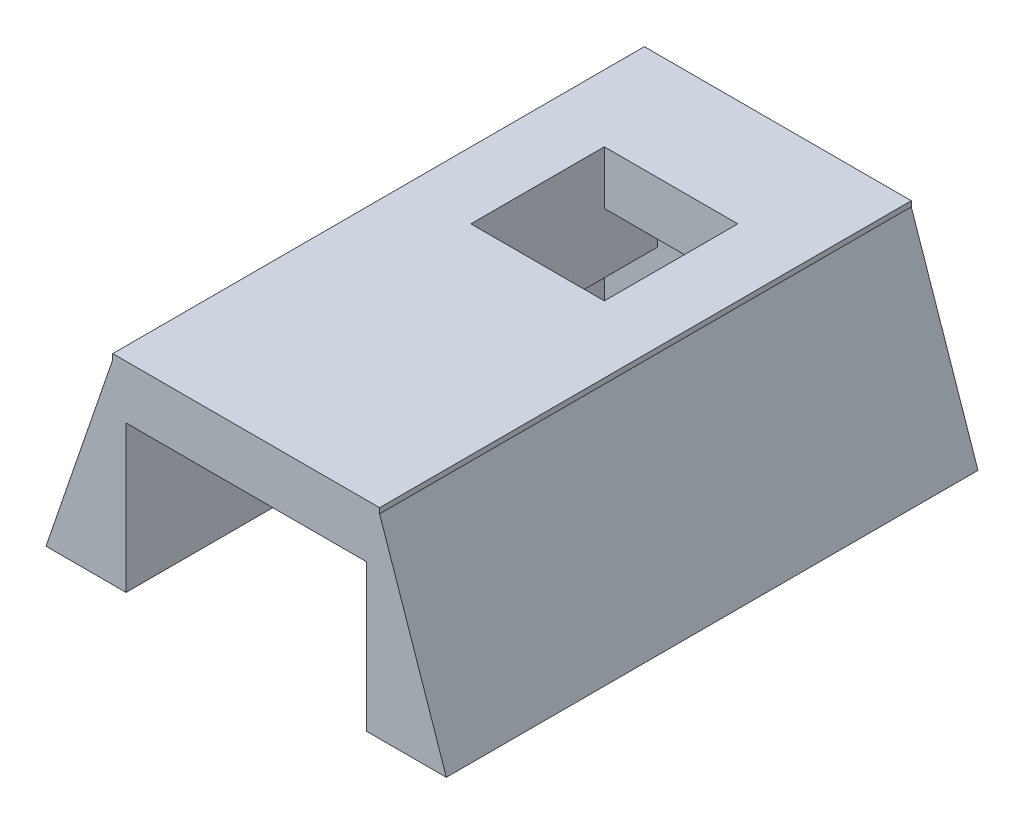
ISO-10303-21;
HEADER;
FILE_DESCRIPTION(('STEP AP214'),'2;1');
FILE_NAME('part.step','',(''),(''),'','','');
FILE_SCHEMA(('AUTOMOTIVE_DESIGN { 1 0 10303 214 1 1 1 1 }'));
ENDSEC;
DATA;
#1=APPLICATION_CONTEXT('core data for automotive mechanical design processes');
#2=APPLICATION_PROTOCOL_DEFINITION('international standard','automotive_design',2000,#1);
#3=PRODUCT_CONTEXT('',#1,'mechanical');
#4=PRODUCT('Part','Part','',(#3));
#5=PRODUCT_RELATED_PRODUCT_CATEGORY('part','',(#4));
#6=PRODUCT_DEFINITION_FORMATION('','',#4);
#7=PRODUCT_DEFINITION_CONTEXT('part definition',#1,'design');
#8=PRODUCT_DEFINITION('design','',#6,#7);
#9=PRODUCT_DEFINITION_SHAPE('','',#8);
#10=(LENGTH_UNIT() NAMED_UNIT(*) SI_UNIT(.MILLI.,.METRE.));
#11=(NAMED_UNIT(*) PLANE_ANGLE_UNIT() SI_UNIT($,.RADIAN.));
#12=(NAMED_UNIT(*) SI_UNIT($,.STERADIAN.) SOLID_ANGLE_UNIT());
#13=UNCERTAINTY_MEASURE_WITH_UNIT(LENGTH_MEASURE(1.E-05),#10,'distance_accuracy_value','');
#14=(GEOMETRIC_REPRESENTATION_CONTEXT(3) GLOBAL_UNCERTAINTY_ASSIGNED_CONTEXT((#13)) GLOBAL_UNIT_ASSIGNED_CONTEXT((#10,
#11,#12)) REPRESENTATION_CONTEXT('',''));
#15=CARTESIAN_POINT('',(0.,0.,0.));
#16=DIRECTION('',(0.,0.,1.));
#17=DIRECTION('',(1.,0.,0.));
#18=AXIS2_PLACEMENT_3D('',#15,#16,#17);
#19=CARTESIAN_POINT('',(0.,5.5,0.));
#20=DIRECTION('',(0.,-1.,0.));
#21=DIRECTION('',(1.,0.,0.));
#22=AXIS2_PLACEMENT_3D('',#19,#20,#21);
#23=PLANE('',#22);
#24=DIRECTION('',(1.,0.,0.));
#25=VECTOR('',#24,1.);
#26=CARTESIAN_POINT('',(0.,5.5,4.));
#27=LINE('',#26,#25);
#28=CARTESIAN_POINT('',(-2.5,5.5,4.));
#29=VERTEX_POINT('',#28);
#30=CARTESIAN_POINT('',(2.5,5.5,4.));
#31=VERTEX_POINT('',#30);
#32=EDGE_CURVE('E11',#29,#31,#27,.T.);
#33=ORIENTED_EDGE('',*,*,#32,.F.);
#34=DIRECTION('',(0.,0.,1.));
#35=VECTOR('',#34,1.);
#36=CARTESIAN_POINT('',(-2.5,5.5,11.));
#37=LINE('',#36,#35);
#38=CARTESIAN_POINT('',(-2.5,5.5,2.));
#39=VERTEX_POINT('',#38);
#40=EDGE_CURVE('E238',#39,#29,#37,.T.);
#41=ORIENTED_EDGE('',*,*,#40,.F.);
#42=DIRECTION('',(-1.,0.,0.));
#43=VECTOR('',#42,1.);
#44=CARTESIAN_POINT('',(0.,5.5,2.));
#45=LINE('',#44,#43);
#46=CARTESIAN_POINT('',(2.5,5.5,2.));
#47=VERTEX_POINT('',#46);
#48=EDGE_CURVE('E203',#47,#39,#45,.T.);
#49=ORIENTED_EDGE('',*,*,#48,.F.);
#50=DIRECTION('',(0.,0.,-1.));
#51=VECTOR('',#50,1.);
#52=CARTESIAN_POINT('',(2.5,5.5,11.));
#53=LINE('',#52,#51);
#54=EDGE_CURVE('E234',#31,#47,#53,.T.);
#55=ORIENTED_EDGE('',*,*,#54,.F.);
#56=EDGE_LOOP('',(#33,#41,#49,#55));
#57=FACE_BOUND('',#56,.T.);
#58=ADVANCED_FACE('F34',(#57),#23,.T.);
#59=CARTESIAN_POINT('',(-4.5,5.5,11.));
#60=DIRECTION('',(1.,0.,0.));
#61=DIRECTION('',(0.,0.,-1.));
#62=AXIS2_PLACEMENT_3D('',#59,#60,#61);
#63=PLANE('',#62);
#64=DIRECTION('',(0.,0.,1.));
#65=VECTOR('',#64,1.);
#66=CARTESIAN_POINT('',(-4.5,0.,11.));
#67=LINE('',#66,#65);
#68=CARTESIAN_POINT('',(-4.5,0.,2.));
#69=VERTEX_POINT('',#68);
#70=CARTESIAN_POINT('',(-4.5,0.,19.92051609));
#71=VERTEX_POINT('',#70);
#72=EDGE_CURVE('E230',#69,#71,#67,.T.);
#73=ORIENTED_EDGE('',*,*,#72,.F.);
#74=DIRECTION('',(0.,1.,0.));
#75=VECTOR('',#74,1.);
#76=CARTESIAN_POINT('',(-4.5,5.5,2.));
#77=LINE('',#76,#75);
#78=CARTESIAN_POINT('',(-4.5,3.25,2.));
#79=VERTEX_POINT('',#78);
#80=EDGE_CURVE('E212',#69,#79,#77,.T.);
#81=ORIENTED_EDGE('',*,*,#80,.T.);
#82=DIRECTION('',(0.,0.,-1.));
#83=VECTOR('',#82,1.);
#84=CARTESIAN_POINT('',(-4.5,3.25,19.92051609));
#85=LINE('',#84,#83);
#86=CARTESIAN_POINT('',(-4.5,3.25,11.));
#87=VERTEX_POINT('',#86);
#88=EDGE_CURVE('E215',#87,#79,#85,.T.);
#89=ORIENTED_EDGE('',*,*,#88,.F.);
#90=DIRECTION('',(0.,-1.,0.));
#91=VECTOR('',#90,1.);
#92=CARTESIAN_POINT('',(-4.5,5.5,11.));
#93=LINE('',#92,#91);
#94=CARTESIAN_POINT('',(-4.5,5.5,11.));
#95=VERTEX_POINT('',#94);
#96=EDGE_CURVE('E261',#95,#87,#93,.T.);
#97=ORIENTED_EDGE('',*,*,#96,.F.);
#98=DIRECTION('',(0.,0.,1.));
#99=VECTOR('',#98,1.);
#100=CARTESIAN_POINT('',(-4.5,5.5,11.));
#101=LINE('',#100,#99);
#102=CARTESIAN_POINT('',(-4.5,5.5,19.92051609));
#103=VERTEX_POINT('',#102);
#104=EDGE_CURVE('E243',#95,#103,#101,.T.);
#105=ORIENTED_EDGE('',*,*,#104,.T.);
#106=DIRECTION('',(0.,-1.,0.));
#107=VECTOR('',#106,1.);
#108=CARTESIAN_POINT('',(-4.5,5.5,19.92051609));
#109=LINE('',#108,#107);
#110=EDGE_CURVE('E258',#103,#71,#109,.T.);
#111=ORIENTED_EDGE('',*,*,#110,.T.);
#112=EDGE_LOOP('',(#73,#81,#89,#97,#105,#111));
#113=FACE_BOUND('',#112,.T.);
#114=ADVANCED_FACE('F329',(#113),#63,.T.);
#115=CARTESIAN_POINT('',(4.5,5.5,11.));
#116=DIRECTION('',(-1.,0.,0.));
#117=DIRECTION('',(0.,0.,1.));
#118=AXIS2_PLACEMENT_3D('',#115,#116,#117);
#119=PLANE('',#118);
#120=DIRECTION('',(0.,0.,-1.));
#121=VECTOR('',#120,1.);
#122=CARTESIAN_POINT('',(4.5,3.25,19.92051609));
#123=LINE('',#122,#121);
#124=CARTESIAN_POINT('',(4.5,3.25,11.));
#125=VERTEX_POINT('',#124);
#126=CARTESIAN_POINT('',(4.5,3.25,2.));
#127=VERTEX_POINT('',#126);
#128=EDGE_CURVE('E216',#125,#127,#123,.T.);
#129=ORIENTED_EDGE('',*,*,#128,.T.);
#130=DIRECTION('',(0.,-1.,0.));
#131=VECTOR('',#130,1.);
#132=CARTESIAN_POINT('',(4.5,5.5,2.));
#133=LINE('',#132,#131);
#134=CARTESIAN_POINT('',(4.5,0.,2.));
#135=VERTEX_POINT('',#134);
#136=EDGE_CURVE('E208',#127,#135,#133,.T.);
#137=ORIENTED_EDGE('',*,*,#136,.T.);
#138=DIRECTION('',(0.,0.,-1.));
#139=VECTOR('',#138,1.);
#140=CARTESIAN_POINT('',(4.5,0.,11.));
#141=LINE('',#140,#139);
#142=CARTESIAN_POINT('',(4.5,0.,19.92051609));
#143=VERTEX_POINT('',#142);
#144=EDGE_CURVE('E235',#143,#135,#141,.T.);
#145=ORIENTED_EDGE('',*,*,#144,.F.);
#146=DIRECTION('',(0.,-1.,0.));
#147=VECTOR('',#146,1.);
#148=CARTESIAN_POINT('',(4.5,5.5,19.92051609));
#149=LINE('',#148,#147);
#150=CARTESIAN_POINT('',(4.5,5.5,19.92051609));
#151=VERTEX_POINT('',#150);
#152=EDGE_CURVE('E256',#151,#143,#149,.T.);
#153=ORIENTED_EDGE('',*,*,#152,.F.);
#154=DIRECTION('',(0.,0.,-1.));
#155=VECTOR('',#154,1.);
#156=CARTESIAN_POINT('',(4.5,5.5,11.));
#157=LINE('',#156,#155);
#158=CARTESIAN_POINT('',(4.5,5.5,11.));
#159=VERTEX_POINT('',#158);
#160=EDGE_CURVE('E248',#151,#159,#157,.T.);
#161=ORIENTED_EDGE('',*,*,#160,.T.);
#162=DIRECTION('',(0.,-1.,0.));
#163=VECTOR('',#162,1.);
#164=CARTESIAN_POINT('',(4.5,5.5,11.));
#165=LINE('',#164,#163);
#166=EDGE_CURVE('E250',#159,#125,#165,.T.);
#167=ORIENTED_EDGE('',*,*,#166,.T.);
#168=EDGE_LOOP('',(#129,#137,#145,#153,#161,#167));
#169=FACE_BOUND('',#168,.T.);
#170=ADVANCED_FACE('F352',(#169),#119,.T.);
#171=CARTESIAN_POINT('',(4.5,3.25,19.92051609));
#172=DIRECTION('',(0.,1.,0.));
#173=DIRECTION('',(0.,0.,1.));
#174=AXIS2_PLACEMENT_3D('',#171,#172,#173);
#175=PLANE('',#174);
#176=DIRECTION('',(-1.,0.,0.));
#177=VECTOR('',#176,1.);
#178=CARTESIAN_POINT('',(-6.,3.25,2.));
#179=LINE('',#178,#177);
#180=CARTESIAN_POINT('',(-2.5,3.25,2.));
#181=VERTEX_POINT('',#180);
#182=EDGE_CURVE('E205',#181,#79,#179,.T.);
#183=ORIENTED_EDGE('',*,*,#182,.F.);
#184=DIRECTION('',(0.,0.,1.));
#185=VECTOR('',#184,1.);
#186=CARTESIAN_POINT('',(-2.5,3.25,11.));
#187=LINE('',#186,#185);
#188=CARTESIAN_POINT('',(-2.5,3.25,11.));
#189=VERTEX_POINT('',#188);
#190=EDGE_CURVE('E224',#181,#189,#187,.T.);
#191=ORIENTED_EDGE('',*,*,#190,.T.);
#192=DIRECTION('',(-1.,0.,0.));
#193=VECTOR('',#192,1.);
#194=CARTESIAN_POINT('',(-2.5,3.25,11.));
#195=LINE('',#194,#193);
#196=EDGE_CURVE('E219',#189,#87,#195,.T.);
#197=ORIENTED_EDGE('',*,*,#196,.T.);
#198=ORIENTED_EDGE('',*,*,#88,.T.);
#199=EDGE_LOOP('',(#183,#191,#197,#198));
#200=FACE_BOUND('',#199,.T.);
#201=ADVANCED_FACE('F333',(#200),#175,.F.);
#202=DIRECTION('',(-1.,0.,0.));
#203=VECTOR('',#202,1.);
#204=CARTESIAN_POINT('',(4.5,3.25,2.));
#205=LINE('',#204,#203);
#206=CARTESIAN_POINT('',(2.5,3.25,2.));
#207=VERTEX_POINT('',#206);
#208=EDGE_CURVE('E314',#127,#207,#205,.T.);
#209=ORIENTED_EDGE('',*,*,#208,.F.);
#210=ORIENTED_EDGE('',*,*,#128,.F.);
#211=DIRECTION('',(-1.,0.,0.));
#212=VECTOR('',#211,1.);
#213=CARTESIAN_POINT('',(2.5,3.25,11.));
#214=LINE('',#213,#212);
#215=CARTESIAN_POINT('',(2.5,3.25,11.));
#216=VERTEX_POINT('',#215);
#217=EDGE_CURVE('E228',#125,#216,#214,.T.);
#218=ORIENTED_EDGE('',*,*,#217,.T.);
#219=DIRECTION('',(0.,0.,-1.));
#220=VECTOR('',#219,1.);
#221=CARTESIAN_POINT('',(2.5,3.25,11.));
#222=LINE('',#221,#220);
#223=EDGE_CURVE('E226',#216,#207,#222,.T.);
#224=ORIENTED_EDGE('',*,*,#223,.T.);
#225=EDGE_LOOP('',(#209,#210,#218,#224));
#226=FACE_BOUND('',#225,.T.);
#227=ADVANCED_FACE('F349',(#226),#175,.F.);
#228=CARTESIAN_POINT('',(-7.5,0.,19.92051609));
#229=DIRECTION('',(0.,1.,0.));
#230=DIRECTION('',(-1.,0.,0.));
#231=AXIS2_PLACEMENT_3D('',#228,#229,#230);
#232=PLANE('',#231);
#233=ORIENTED_EDGE('',*,*,#144,.T.);
#234=DIRECTION('',(1.,0.,0.));
#235=VECTOR('',#234,1.);
#236=CARTESIAN_POINT('',(-6.,0.,2.));
#237=LINE('',#236,#235);
#238=EDGE_CURVE('E206',#69,#135,#237,.T.);
#239=ORIENTED_EDGE('',*,*,#238,.F.);
#240=ORIENTED_EDGE('',*,*,#72,.T.);
#241=DIRECTION('',(1.,0.,0.));
#242=VECTOR('',#241,1.);
#243=CARTESIAN_POINT('',(-7.5,0.,19.92051609));
#244=LINE('',#243,#242);
#245=CARTESIAN_POINT('',(-7.5,0.,19.92051609));
#246=VERTEX_POINT('',#245);
#247=EDGE_CURVE('E271',#246,#71,#244,.T.);
#248=ORIENTED_EDGE('',*,*,#247,.F.);
#249=DIRECTION('',(0.,0.,-1.));
#250=VECTOR('',#249,1.);
#251=CARTESIAN_POINT('',(-7.5,0.,19.92051609));
#252=LINE('',#251,#250);
#253=CARTESIAN_POINT('',(-7.5,0.,0.));
#254=VERTEX_POINT('',#253);
#255=EDGE_CURVE('E285',#246,#254,#252,.T.);
#256=ORIENTED_EDGE('',*,*,#255,.T.);
#257=DIRECTION('',(1.,0.,0.));
#258=VECTOR('',#257,1.);
#259=CARTESIAN_POINT('',(-7.5,0.,0.));
#260=LINE('',#259,#258);
#261=CARTESIAN_POINT('',(7.5,0.,0.));
#262=VERTEX_POINT('',#261);
#263=EDGE_CURVE('E270',#254,#262,#260,.T.);
#264=ORIENTED_EDGE('',*,*,#263,.T.);
#265=DIRECTION('',(0.,0.,-1.));
#266=VECTOR('',#265,1.);
#267=CARTESIAN_POINT('',(7.5,0.,19.92051609));
#268=LINE('',#267,#266);
#269=CARTESIAN_POINT('',(7.5,0.,19.92051609));
#270=VERTEX_POINT('',#269);
#271=EDGE_CURVE('E311',#270,#262,#268,.T.);
#272=ORIENTED_EDGE('',*,*,#271,.F.);
#273=EDGE_CURVE('E275',#143,#270,#244,.T.);
#274=ORIENTED_EDGE('',*,*,#273,.F.);
#275=EDGE_LOOP('',(#233,#239,#240,#248,#256,#264,#272,#274));
#276=FACE_BOUND('',#275,.T.);
#277=ADVANCED_FACE('F36',(#276),#232,.F.);
#278=CARTESIAN_POINT('',(0.,0.,19.92051609));
#279=DIRECTION('',(0.,0.,1.));
#280=DIRECTION('',(1.,0.,0.));
#281=AXIS2_PLACEMENT_3D('',#278,#279,#280);
#282=PLANE('',#281);
#283=ORIENTED_EDGE('',*,*,#247,.T.);
#284=ORIENTED_EDGE('',*,*,#110,.F.);
#285=DIRECTION('',(1.,0.,0.));
#286=VECTOR('',#285,1.);
#287=CARTESIAN_POINT('',(-4.5,5.5,19.92051609));
#288=LINE('',#287,#286);
#289=EDGE_CURVE('E245',#103,#151,#288,.T.);
#290=ORIENTED_EDGE('',*,*,#289,.T.);
#291=ORIENTED_EDGE('',*,*,#152,.T.);
#292=ORIENTED_EDGE('',*,*,#273,.T.);
#293=DIRECTION('',(-0.32399297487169,0.946059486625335,0.));
#294=VECTOR('',#293,1.);
#295=CARTESIAN_POINT('',(7.5,0.,19.92051609));
#296=LINE('',#295,#294);
#297=CARTESIAN_POINT('',(5.,7.3,19.92051609));
#298=VERTEX_POINT('',#297);
#299=EDGE_CURVE('E274',#270,#298,#296,.T.);
#300=ORIENTED_EDGE('',*,*,#299,.T.);
#301=DIRECTION('',(0.,1.,0.));
#302=VECTOR('',#301,1.);
#303=CARTESIAN_POINT('',(5.,7.3,19.92051609));
#304=LINE('',#303,#302);
#305=CARTESIAN_POINT('',(5.,7.5,19.92051609));
#306=VERTEX_POINT('',#305);
#307=EDGE_CURVE('E277',#298,#306,#304,.T.);
#308=ORIENTED_EDGE('',*,*,#307,.T.);
#309=DIRECTION('',(-1.,0.,0.));
#310=VECTOR('',#309,1.);
#311=CARTESIAN_POINT('',(-5.,7.5,19.92051609));
#312=LINE('',#311,#310);
#313=CARTESIAN_POINT('',(-5.,7.5,19.92051609));
#314=VERTEX_POINT('',#313);
#315=EDGE_CURVE('E279',#306,#314,#312,.T.);
#316=ORIENTED_EDGE('',*,*,#315,.T.);
#317=DIRECTION('',(0.,-1.,0.));
#318=VECTOR('',#317,1.);
#319=CARTESIAN_POINT('',(-5.,7.3,19.92051609));
#320=LINE('',#319,#318);
#321=CARTESIAN_POINT('',(-5.,7.3,19.92051609));
#322=VERTEX_POINT('',#321);
#323=EDGE_CURVE('E281',#314,#322,#320,.T.);
#324=ORIENTED_EDGE('',*,*,#323,.T.);
#325=DIRECTION('',(-0.32399297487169,-0.946059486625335,0.));
#326=VECTOR('',#325,1.);
#327=CARTESIAN_POINT('',(-7.5,0.,19.92051609));
#328=LINE('',#327,#326);
#329=EDGE_CURVE('E283',#322,#246,#328,.T.);
#330=ORIENTED_EDGE('',*,*,#329,.T.);
#331=EDGE_LOOP('',(#283,#284,#290,#291,#292,#300,#308,#316,#324,#330));
#332=FACE_BOUND('',#331,.T.);
#333=ADVANCED_FACE('F361',(#332),#282,.T.);
#334=CARTESIAN_POINT('',(0.,0.,0.));
#335=DIRECTION('',(0.,0.,1.));
#336=DIRECTION('',(1.,0.,0.));
#337=AXIS2_PLACEMENT_3D('',#334,#335,#336);
#338=PLANE('',#337);
#339=DIRECTION('',(-0.32399297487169,0.946059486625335,0.));
#340=VECTOR('',#339,1.);
#341=CARTESIAN_POINT('',(7.5,0.,0.));
#342=LINE('',#341,#340);
#343=CARTESIAN_POINT('',(5.,7.3,0.));
#344=VERTEX_POINT('',#343);
#345=EDGE_CURVE('E287',#262,#344,#342,.T.);
#346=ORIENTED_EDGE('',*,*,#345,.F.);
#347=ORIENTED_EDGE('',*,*,#263,.F.);
#348=DIRECTION('',(-0.32399297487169,-0.946059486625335,0.));
#349=VECTOR('',#348,1.);
#350=CARTESIAN_POINT('',(-7.5,0.,0.));
#351=LINE('',#350,#349);
#352=CARTESIAN_POINT('',(-5.,7.3,0.));
#353=VERTEX_POINT('',#352);
#354=EDGE_CURVE('E295',#353,#254,#351,.T.);
#355=ORIENTED_EDGE('',*,*,#354,.F.);
#356=DIRECTION('',(0.,-1.,0.));
#357=VECTOR('',#356,1.);
#358=CARTESIAN_POINT('',(-5.,7.3,0.));
#359=LINE('',#358,#357);
#360=CARTESIAN_POINT('',(-5.,7.5,0.));
#361=VERTEX_POINT('',#360);
#362=EDGE_CURVE('E293',#361,#353,#359,.T.);
#363=ORIENTED_EDGE('',*,*,#362,.F.);
#364=DIRECTION('',(-1.,0.,0.));
#365=VECTOR('',#364,1.);
#366=CARTESIAN_POINT('',(-5.,7.5,0.));
#367=LINE('',#366,#365);
#368=CARTESIAN_POINT('',(5.,7.5,0.));
#369=VERTEX_POINT('',#368);
#370=EDGE_CURVE('E291',#369,#361,#367,.T.);
#371=ORIENTED_EDGE('',*,*,#370,.F.);
#372=DIRECTION('',(0.,1.,0.));
#373=VECTOR('',#372,1.);
#374=CARTESIAN_POINT('',(5.,7.3,0.));
#375=LINE('',#374,#373);
#376=EDGE_CURVE('E289',#344,#369,#375,.T.);
#377=ORIENTED_EDGE('',*,*,#376,.F.);
#378=EDGE_LOOP('',(#346,#347,#355,#363,#371,#377));
#379=FACE_BOUND('',#378,.T.);
#380=ADVANCED_FACE('F392',(#379),#338,.F.);
#381=CARTESIAN_POINT('',(7.5,0.,19.92051609));
#382=DIRECTION('',(-0.946059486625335,-0.32399297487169,0.));
#383=DIRECTION('',(0.32399297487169,-0.946059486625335,0.));
#384=AXIS2_PLACEMENT_3D('',#381,#382,#383);
#385=PLANE('',#384);
#386=ORIENTED_EDGE('',*,*,#345,.T.);
#387=DIRECTION('',(0.,0.,-1.));
#388=VECTOR('',#387,1.);
#389=CARTESIAN_POINT('',(5.,7.3,19.92051609));
#390=LINE('',#389,#388);
#391=EDGE_CURVE('E308',#298,#344,#390,.T.);
#392=ORIENTED_EDGE('',*,*,#391,.F.);
#393=ORIENTED_EDGE('',*,*,#299,.F.);
#394=ORIENTED_EDGE('',*,*,#271,.T.);
#395=EDGE_LOOP('',(#386,#392,#393,#394));
#396=FACE_BOUND('',#395,.T.);
#397=ADVANCED_FACE('F370',(#396),#385,.F.);
#398=CARTESIAN_POINT('',(5.,7.3,19.92051609));
#399=DIRECTION('',(-1.,0.,0.));
#400=DIRECTION('',(0.,0.,1.));
#401=AXIS2_PLACEMENT_3D('',#398,#399,#400);
#402=PLANE('',#401);
#403=ORIENTED_EDGE('',*,*,#376,.T.);
#404=DIRECTION('',(0.,0.,-1.));
#405=VECTOR('',#404,1.);
#406=CARTESIAN_POINT('',(5.,7.5,19.92051609));
#407=LINE('',#406,#405);
#408=EDGE_CURVE('E305',#306,#369,#407,.T.);
#409=ORIENTED_EDGE('',*,*,#408,.F.);
#410=ORIENTED_EDGE('',*,*,#307,.F.);
#411=ORIENTED_EDGE('',*,*,#391,.T.);
#412=EDGE_LOOP('',(#403,#409,#410,#411));
#413=FACE_BOUND('',#412,.T.);
#414=ADVANCED_FACE('F376',(#413),#402,.F.);
#415=CARTESIAN_POINT('',(-5.,7.5,19.92051609));
#416=DIRECTION('',(0.,-1.,0.));
#417=DIRECTION('',(1.,0.,0.));
#418=AXIS2_PLACEMENT_3D('',#415,#416,#417);
#419=PLANE('',#418);
#420=DIRECTION('',(1.,0.,0.));
#421=VECTOR('',#420,1.);
#422=CARTESIAN_POINT('',(2.5,7.5,9.));
#423=LINE('',#422,#421);
#424=CARTESIAN_POINT('',(-2.5,7.5,9.));
#425=VERTEX_POINT('',#424);
#426=CARTESIAN_POINT('',(2.5,7.5,9.));
#427=VERTEX_POINT('',#426);
#428=EDGE_CURVE('E182',#425,#427,#423,.T.);
#429=ORIENTED_EDGE('',*,*,#428,.F.);
#430=DIRECTION('',(0.,0.,1.));
#431=VECTOR('',#430,1.);
#432=CARTESIAN_POINT('',(-2.5,7.5,9.));
#433=LINE('',#432,#431);
#434=CARTESIAN_POINT('',(-2.5,7.5,4.));
#435=VERTEX_POINT('',#434);
#436=EDGE_CURVE('E49',#435,#425,#433,.T.);
#437=ORIENTED_EDGE('',*,*,#436,.F.);
#438=DIRECTION('',(-1.,0.,0.));
#439=VECTOR('',#438,1.);
#440=CARTESIAN_POINT('',(2.5,7.5,4.));
#441=LINE('',#440,#439);
#442=CARTESIAN_POINT('',(2.5,7.5,4.));
#443=VERTEX_POINT('',#442);
#444=EDGE_CURVE('E189',#443,#435,#441,.T.);
#445=ORIENTED_EDGE('',*,*,#444,.F.);
#446=DIRECTION('',(0.,0.,-1.));
#447=VECTOR('',#446,1.);
#448=CARTESIAN_POINT('',(2.5,7.5,9.));
#449=LINE('',#448,#447);
#450=EDGE_CURVE('E174',#427,#443,#449,.T.);
#451=ORIENTED_EDGE('',*,*,#450,.F.);
#452=EDGE_LOOP('',(#429,#437,#445,#451));
#453=FACE_BOUND('',#452,.T.);
#454=ORIENTED_EDGE('',*,*,#370,.T.);
#455=DIRECTION('',(0.,0.,-1.));
#456=VECTOR('',#455,1.);
#457=CARTESIAN_POINT('',(-5.,7.5,19.92051609));
#458=LINE('',#457,#456);
#459=EDGE_CURVE('E302',#314,#361,#458,.T.);
#460=ORIENTED_EDGE('',*,*,#459,.F.);
#461=ORIENTED_EDGE('',*,*,#315,.F.);
#462=ORIENTED_EDGE('',*,*,#408,.T.);
#463=EDGE_LOOP('',(#454,#460,#461,#462));
#464=FACE_BOUND('',#463,.T.);
#465=ADVANCED_FACE('F186',(#453,#464),#419,.F.);
#466=CARTESIAN_POINT('',(-5.,7.3,19.92051609));
#467=DIRECTION('',(1.,0.,0.));
#468=DIRECTION('',(0.,0.,-1.));
#469=AXIS2_PLACEMENT_3D('',#466,#467,#468);
#470=PLANE('',#469);
#471=ORIENTED_EDGE('',*,*,#362,.T.);
#472=DIRECTION('',(0.,0.,-1.));
#473=VECTOR('',#472,1.);
#474=CARTESIAN_POINT('',(-5.,7.3,19.92051609));
#475=LINE('',#474,#473);
#476=EDGE_CURVE('E299',#322,#353,#475,.T.);
#477=ORIENTED_EDGE('',*,*,#476,.F.);
#478=ORIENTED_EDGE('',*,*,#323,.F.);
#479=ORIENTED_EDGE('',*,*,#459,.T.);
#480=EDGE_LOOP('',(#471,#477,#478,#479));
#481=FACE_BOUND('',#480,.T.);
#482=ADVANCED_FACE('F384',(#481),#470,.F.);
#483=CARTESIAN_POINT('',(-7.5,0.,19.92051609));
#484=DIRECTION('',(0.946059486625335,-0.32399297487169,0.));
#485=DIRECTION('',(0.32399297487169,0.946059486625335,0.));
#486=AXIS2_PLACEMENT_3D('',#483,#484,#485);
#487=PLANE('',#486);
#488=ORIENTED_EDGE('',*,*,#354,.T.);
#489=ORIENTED_EDGE('',*,*,#255,.F.);
#490=ORIENTED_EDGE('',*,*,#329,.F.);
#491=ORIENTED_EDGE('',*,*,#476,.T.);
#492=EDGE_LOOP('',(#488,#489,#490,#491));
#493=FACE_BOUND('',#492,.T.);
#494=ADVANCED_FACE('F389',(#493),#487,.F.);
#495=CARTESIAN_POINT('',(2.5,5.5,11.));
#496=DIRECTION('',(0.,0.,1.));
#497=DIRECTION('',(1.,0.,0.));
#498=AXIS2_PLACEMENT_3D('',#495,#496,#497);
#499=PLANE('',#498);
#500=ORIENTED_EDGE('',*,*,#217,.F.);
#501=ORIENTED_EDGE('',*,*,#166,.F.);
#502=DIRECTION('',(-1.,0.,0.));
#503=VECTOR('',#502,1.);
#504=CARTESIAN_POINT('',(2.5,5.5,11.));
#505=LINE('',#504,#503);
#506=CARTESIAN_POINT('',(2.5,5.5,11.));
#507=VERTEX_POINT('',#506);
#508=EDGE_CURVE('E231',#159,#507,#505,.T.);
#509=ORIENTED_EDGE('',*,*,#508,.T.);
#510=DIRECTION('',(0.,-1.,0.));
#511=VECTOR('',#510,1.);
#512=CARTESIAN_POINT('',(2.5,5.5,11.));
#513=LINE('',#512,#511);
#514=EDGE_CURVE('E267',#507,#216,#513,.T.);
#515=ORIENTED_EDGE('',*,*,#514,.T.);
#516=EDGE_LOOP('',(#500,#501,#509,#515));
#517=FACE_BOUND('',#516,.T.);
#518=ADVANCED_FACE('F358',(#517),#499,.T.);
#519=CARTESIAN_POINT('',(2.5,5.5,11.));
#520=DIRECTION('',(-1.,0.,0.));
#521=DIRECTION('',(0.,-1.,0.));
#522=AXIS2_PLACEMENT_3D('',#519,#520,#521);
#523=PLANE('',#522);
#524=CARTESIAN_POINT('',(2.5,5.5,9.));
#525=VERTEX_POINT('',#524);
#526=EDGE_CURVE('E177',#507,#525,#53,.T.);
#527=ORIENTED_EDGE('',*,*,#526,.T.);
#528=DIRECTION('',(0.,1.,0.));
#529=VECTOR('',#528,1.);
#530=CARTESIAN_POINT('',(2.5,0.,9.));
#531=LINE('',#530,#529);
#532=EDGE_CURVE('E57',#525,#427,#531,.T.);
#533=ORIENTED_EDGE('',*,*,#532,.T.);
#534=ORIENTED_EDGE('',*,*,#450,.T.);
#535=DIRECTION('',(0.,1.,0.));
#536=VECTOR('',#535,1.);
#537=CARTESIAN_POINT('',(2.5,0.,4.));
#538=LINE('',#537,#536);
#539=EDGE_CURVE('E178',#31,#443,#538,.T.);
#540=ORIENTED_EDGE('',*,*,#539,.F.);
#541=ORIENTED_EDGE('',*,*,#54,.T.);
#542=DIRECTION('',(0.,1.,0.));
#543=VECTOR('',#542,1.);
#544=CARTESIAN_POINT('',(2.5,5.5,2.));
#545=LINE('',#544,#543);
#546=EDGE_CURVE('E200',#207,#47,#545,.T.);
#547=ORIENTED_EDGE('',*,*,#546,.F.);
#548=ORIENTED_EDGE('',*,*,#223,.F.);
#549=ORIENTED_EDGE('',*,*,#514,.F.);
#550=EDGE_LOOP('',(#527,#533,#534,#540,#541,#547,#548,#549));
#551=FACE_BOUND('',#550,.T.);
#552=ADVANCED_FACE('F171',(#551),#523,.T.);
#553=CARTESIAN_POINT('',(-2.5,5.5,11.));
#554=DIRECTION('',(1.,0.,0.));
#555=DIRECTION('',(0.,1.,0.));
#556=AXIS2_PLACEMENT_3D('',#553,#554,#555);
#557=PLANE('',#556);
#558=DIRECTION('',(0.,-1.,0.));
#559=VECTOR('',#558,1.);
#560=CARTESIAN_POINT('',(-2.5,5.5,11.));
#561=LINE('',#560,#559);
#562=CARTESIAN_POINT('',(-2.5,5.5,11.));
#563=VERTEX_POINT('',#562);
#564=EDGE_CURVE('E264',#563,#189,#561,.T.);
#565=ORIENTED_EDGE('',*,*,#564,.T.);
#566=ORIENTED_EDGE('',*,*,#190,.F.);
#567=DIRECTION('',(0.,-1.,0.));
#568=VECTOR('',#567,1.);
#569=CARTESIAN_POINT('',(-2.5,5.5,2.));
#570=LINE('',#569,#568);
#571=EDGE_CURVE('E196',#39,#181,#570,.T.);
#572=ORIENTED_EDGE('',*,*,#571,.F.);
#573=ORIENTED_EDGE('',*,*,#40,.T.);
#574=DIRECTION('',(0.,1.,0.));
#575=VECTOR('',#574,1.);
#576=CARTESIAN_POINT('',(-2.5,0.,4.));
#577=LINE('',#576,#575);
#578=EDGE_CURVE('E194',#29,#435,#577,.T.);
#579=ORIENTED_EDGE('',*,*,#578,.T.);
#580=ORIENTED_EDGE('',*,*,#436,.T.);
#581=DIRECTION('',(0.,1.,0.));
#582=VECTOR('',#581,1.);
#583=CARTESIAN_POINT('',(-2.5,0.,9.));
#584=LINE('',#583,#582);
#585=CARTESIAN_POINT('',(-2.5,5.5,9.));
#586=VERTEX_POINT('',#585);
#587=EDGE_CURVE('E179',#586,#425,#584,.T.);
#588=ORIENTED_EDGE('',*,*,#587,.F.);
#589=EDGE_CURVE('E237',#586,#563,#37,.T.);
#590=ORIENTED_EDGE('',*,*,#589,.T.);
#591=EDGE_LOOP('',(#565,#566,#572,#573,#579,#580,#588,#590));
#592=FACE_BOUND('',#591,.T.);
#593=ADVANCED_FACE('F318',(#592),#557,.T.);
#594=CARTESIAN_POINT('',(-2.5,5.5,11.));
#595=DIRECTION('',(0.,0.,1.));
#596=DIRECTION('',(1.,0.,0.));
#597=AXIS2_PLACEMENT_3D('',#594,#595,#596);
#598=PLANE('',#597);
#599=ORIENTED_EDGE('',*,*,#196,.F.);
#600=ORIENTED_EDGE('',*,*,#564,.F.);
#601=DIRECTION('',(-1.,0.,0.));
#602=VECTOR('',#601,1.);
#603=CARTESIAN_POINT('',(-2.5,5.5,11.));
#604=LINE('',#603,#602);
#605=EDGE_CURVE('E241',#563,#95,#604,.T.);
#606=ORIENTED_EDGE('',*,*,#605,.T.);
#607=ORIENTED_EDGE('',*,*,#96,.T.);
#608=EDGE_LOOP('',(#599,#600,#606,#607));
#609=FACE_BOUND('',#608,.T.);
#610=ADVANCED_FACE('F327',(#609),#598,.T.);
#611=DIRECTION('',(-1.,0.,0.));
#612=VECTOR('',#611,1.);
#613=CARTESIAN_POINT('',(0.,5.5,9.));
#614=LINE('',#613,#612);
#615=EDGE_CURVE('E42',#525,#586,#614,.T.);
#616=ORIENTED_EDGE('',*,*,#615,.F.);
#617=ORIENTED_EDGE('',*,*,#526,.F.);
#618=ORIENTED_EDGE('',*,*,#508,.F.);
#619=ORIENTED_EDGE('',*,*,#160,.F.);
#620=ORIENTED_EDGE('',*,*,#289,.F.);
#621=ORIENTED_EDGE('',*,*,#104,.F.);
#622=ORIENTED_EDGE('',*,*,#605,.F.);
#623=ORIENTED_EDGE('',*,*,#589,.F.);
#624=EDGE_LOOP('',(#616,#617,#618,#619,#620,#621,#622,#623));
#625=FACE_BOUND('',#624,.T.);
#626=ADVANCED_FACE('F321',(#625),#23,.T.);
#627=CARTESIAN_POINT('',(-6.,-12.1655250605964,2.));
#628=DIRECTION('',(0.,0.,-1.));
#629=DIRECTION('',(-1.,0.,0.));
#630=AXIS2_PLACEMENT_3D('',#627,#628,#629);
#631=PLANE('',#630);
#632=ORIENTED_EDGE('',*,*,#208,.T.);
#633=ORIENTED_EDGE('',*,*,#546,.T.);
#634=ORIENTED_EDGE('',*,*,#48,.T.);
#635=ORIENTED_EDGE('',*,*,#571,.T.);
#636=ORIENTED_EDGE('',*,*,#182,.T.);
#637=ORIENTED_EDGE('',*,*,#80,.F.);
#638=ORIENTED_EDGE('',*,*,#238,.T.);
#639=ORIENTED_EDGE('',*,*,#136,.F.);
#640=EDGE_LOOP('',(#632,#633,#634,#635,#636,#637,#638,#639));
#641=FACE_BOUND('',#640,.T.);
#642=ADVANCED_FACE('F346',(#641),#631,.F.);
#643=CARTESIAN_POINT('',(2.5,0.,4.));
#644=DIRECTION('',(0.,0.,-1.));
#645=DIRECTION('',(-1.,0.,0.));
#646=AXIS2_PLACEMENT_3D('',#643,#644,#645);
#647=PLANE('',#646);
#648=ORIENTED_EDGE('',*,*,#32,.T.);
#649=ORIENTED_EDGE('',*,*,#539,.T.);
#650=ORIENTED_EDGE('',*,*,#444,.T.);
#651=ORIENTED_EDGE('',*,*,#578,.F.);
#652=EDGE_LOOP('',(#648,#649,#650,#651));
#653=FACE_BOUND('',#652,.T.);
#654=ADVANCED_FACE('F343',(#653),#647,.F.);
#655=CARTESIAN_POINT('',(2.5,0.,9.));
#656=DIRECTION('',(0.,0.,1.));
#657=DIRECTION('',(1.,0.,0.));
#658=AXIS2_PLACEMENT_3D('',#655,#656,#657);
#659=PLANE('',#658);
#660=ORIENTED_EDGE('',*,*,#615,.T.);
#661=ORIENTED_EDGE('',*,*,#587,.T.);
#662=ORIENTED_EDGE('',*,*,#428,.T.);
#663=ORIENTED_EDGE('',*,*,#532,.F.);
#664=EDGE_LOOP('',(#660,#661,#662,#663));
#665=FACE_BOUND('',#664,.T.);
#666=ADVANCED_FACE('F183',(#665),#659,.F.);
#667=CLOSED_SHELL('',(#58,#114,#170,#201,#227,#277,#333,#380,#397,#414,#465,#482,#494,#518,#552,
#593,#610,#626,#642,#654,#666));
#668=MANIFOLD_SOLID_BREP('B2',#667);
#669=ADVANCED_BREP_SHAPE_REPRESENTATION('',(#18,#668),#14);
#670=SHAPE_DEFINITION_REPRESENTATION(#9,#669);
ENDSEC;
END-ISO-10303-21;
